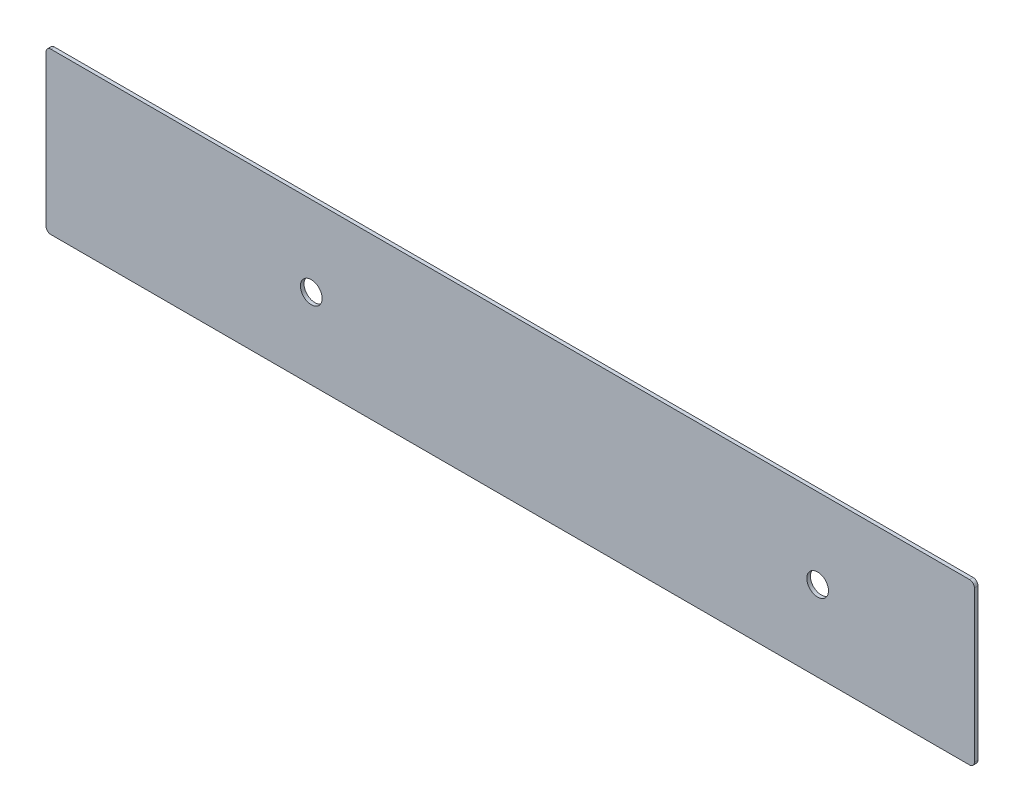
ISO-10303-21;
HEADER;
FILE_DESCRIPTION(('STEP AP214'),'2;1');
FILE_NAME('part.step','',(''),(''),'','','');
FILE_SCHEMA(('AUTOMOTIVE_DESIGN { 1 0 10303 214 1 1 1 1 }'));
ENDSEC;
DATA;
#1=APPLICATION_CONTEXT('core data for automotive mechanical design processes');
#2=APPLICATION_PROTOCOL_DEFINITION('international standard','automotive_design',2000,#1);
#3=PRODUCT_CONTEXT('',#1,'mechanical');
#4=PRODUCT('Part','Part','',(#3));
#5=PRODUCT_RELATED_PRODUCT_CATEGORY('part','',(#4));
#6=PRODUCT_DEFINITION_FORMATION('','',#4);
#7=PRODUCT_DEFINITION_CONTEXT('part definition',#1,'design');
#8=PRODUCT_DEFINITION('design','',#6,#7);
#9=PRODUCT_DEFINITION_SHAPE('','',#8);
#10=(LENGTH_UNIT() NAMED_UNIT(*) SI_UNIT(.MILLI.,.METRE.));
#11=(NAMED_UNIT(*) PLANE_ANGLE_UNIT() SI_UNIT($,.RADIAN.));
#12=(NAMED_UNIT(*) SI_UNIT($,.STERADIAN.) SOLID_ANGLE_UNIT());
#13=UNCERTAINTY_MEASURE_WITH_UNIT(LENGTH_MEASURE(1.E-05),#10,'distance_accuracy_value','');
#14=(GEOMETRIC_REPRESENTATION_CONTEXT(3) GLOBAL_UNCERTAINTY_ASSIGNED_CONTEXT((#13)) GLOBAL_UNIT_ASSIGNED_CONTEXT((#10,
#11,#12)) REPRESENTATION_CONTEXT('',''));
#15=CARTESIAN_POINT('',(0.,0.,0.));
#16=DIRECTION('',(0.,0.,1.));
#17=DIRECTION('',(1.,0.,0.));
#18=AXIS2_PLACEMENT_3D('',#15,#16,#17);
#19=CARTESIAN_POINT('',(0.,0.,1.5));
#20=DIRECTION('',(0.,0.,-1.));
#21=DIRECTION('',(-1.,0.,0.));
#22=AXIS2_PLACEMENT_3D('',#19,#20,#21);
#23=PLANE('',#22);
#24=DIRECTION('',(0.,1.,0.));
#25=VECTOR('',#24,1.);
#26=CARTESIAN_POINT('',(385.,0.,1.5));
#27=LINE('',#26,#25);
#28=CARTESIAN_POINT('',(385.,2.,1.5));
#29=VERTEX_POINT('',#28);
#30=CARTESIAN_POINT('',(385.,64.6,1.5));
#31=VERTEX_POINT('',#30);
#32=EDGE_CURVE('E173',#29,#31,#27,.T.);
#33=ORIENTED_EDGE('',*,*,#32,.T.);
#34=CARTESIAN_POINT('',(383.,64.6,1.5));
#35=DIRECTION('',(0.,0.,-1.));
#36=DIRECTION('',(-1.,0.,0.));
#37=AXIS2_PLACEMENT_3D('',#34,#35,#36);
#38=CIRCLE('',#37,2.);
#39=CARTESIAN_POINT('',(383.,66.6,1.5));
#40=VERTEX_POINT('',#39);
#41=EDGE_CURVE('E150',#31,#40,#38,.F.);
#42=ORIENTED_EDGE('',*,*,#41,.T.);
#43=DIRECTION('',(-1.,0.,0.));
#44=VECTOR('',#43,1.);
#45=CARTESIAN_POINT('',(0.,66.6,1.5));
#46=LINE('',#45,#44);
#47=CARTESIAN_POINT('',(2.,66.6,1.5));
#48=VERTEX_POINT('',#47);
#49=EDGE_CURVE('E121',#40,#48,#46,.T.);
#50=ORIENTED_EDGE('',*,*,#49,.T.);
#51=CARTESIAN_POINT('',(2.,64.6,1.5));
#52=DIRECTION('',(0.,0.,-1.));
#53=DIRECTION('',(-1.,0.,0.));
#54=AXIS2_PLACEMENT_3D('',#51,#52,#53);
#55=CIRCLE('',#54,2.);
#56=CARTESIAN_POINT('',(0.,64.6,1.5));
#57=VERTEX_POINT('',#56);
#58=EDGE_CURVE('E145',#48,#57,#55,.F.);
#59=ORIENTED_EDGE('',*,*,#58,.T.);
#60=DIRECTION('',(0.,-1.,0.));
#61=VECTOR('',#60,1.);
#62=CARTESIAN_POINT('',(0.,0.,1.5));
#63=LINE('',#62,#61);
#64=CARTESIAN_POINT('',(0.,2.,1.5));
#65=VERTEX_POINT('',#64);
#66=EDGE_CURVE('E128',#57,#65,#63,.T.);
#67=ORIENTED_EDGE('',*,*,#66,.T.);
#68=CARTESIAN_POINT('',(2.,2.,1.5));
#69=DIRECTION('',(0.,0.,-1.));
#70=DIRECTION('',(-1.,0.,0.));
#71=AXIS2_PLACEMENT_3D('',#68,#69,#70);
#72=CIRCLE('',#71,2.);
#73=CARTESIAN_POINT('',(2.,0.,1.5));
#74=VERTEX_POINT('',#73);
#75=EDGE_CURVE('E57',#65,#74,#72,.F.);
#76=ORIENTED_EDGE('',*,*,#75,.T.);
#77=DIRECTION('',(1.,0.,0.));
#78=VECTOR('',#77,1.);
#79=CARTESIAN_POINT('',(0.,0.,1.5));
#80=LINE('',#79,#78);
#81=CARTESIAN_POINT('',(383.,0.,1.5));
#82=VERTEX_POINT('',#81);
#83=EDGE_CURVE('E131',#74,#82,#80,.T.);
#84=ORIENTED_EDGE('',*,*,#83,.T.);
#85=CARTESIAN_POINT('',(383.,2.,1.5));
#86=DIRECTION('',(0.,0.,-1.));
#87=DIRECTION('',(-1.,0.,0.));
#88=AXIS2_PLACEMENT_3D('',#85,#86,#87);
#89=CIRCLE('',#88,2.);
#90=EDGE_CURVE('E148',#82,#29,#89,.F.);
#91=ORIENTED_EDGE('',*,*,#90,.T.);
#92=EDGE_LOOP('',(#33,#42,#50,#59,#67,#76,#84,#91));
#93=FACE_BOUND('',#92,.T.);
#94=CARTESIAN_POINT('',(110.,33.3,1.5));
#95=DIRECTION('',(0.,0.,1.));
#96=DIRECTION('',(1.,0.,0.));
#97=AXIS2_PLACEMENT_3D('',#94,#95,#96);
#98=CIRCLE('',#97,4.50000000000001);
#99=CARTESIAN_POINT('',(114.5,33.3,1.5));
#100=VERTEX_POINT('',#99);
#101=EDGE_CURVE('E166',#100,#100,#98,.T.);
#102=ORIENTED_EDGE('',*,*,#101,.F.);
#103=EDGE_LOOP('',(#102));
#104=FACE_BOUND('',#103,.T.);
#105=CARTESIAN_POINT('',(320.,33.3,1.5));
#106=DIRECTION('',(0.,0.,1.));
#107=DIRECTION('',(1.,0.,0.));
#108=AXIS2_PLACEMENT_3D('',#105,#106,#107);
#109=CIRCLE('',#108,4.50000000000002);
#110=CARTESIAN_POINT('',(324.5,33.3,1.5));
#111=VERTEX_POINT('',#110);
#112=EDGE_CURVE('E178',#111,#111,#109,.T.);
#113=ORIENTED_EDGE('',*,*,#112,.F.);
#114=EDGE_LOOP('',(#113));
#115=FACE_BOUND('',#114,.T.);
#116=ADVANCED_FACE('F35',(#93,#104,#115),#23,.F.);
#117=CARTESIAN_POINT('',(0.,0.,0.));
#118=DIRECTION('',(0.,0.,-1.));
#119=DIRECTION('',(-1.,0.,0.));
#120=AXIS2_PLACEMENT_3D('',#117,#118,#119);
#121=PLANE('',#120);
#122=CARTESIAN_POINT('',(110.,33.3,0.));
#123=DIRECTION('',(0.,0.,1.));
#124=DIRECTION('',(1.,0.,0.));
#125=AXIS2_PLACEMENT_3D('',#122,#123,#124);
#126=CIRCLE('',#125,4.50000000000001);
#127=CARTESIAN_POINT('',(114.5,33.3,0.));
#128=VERTEX_POINT('',#127);
#129=EDGE_CURVE('E169',#128,#128,#126,.T.);
#130=ORIENTED_EDGE('',*,*,#129,.T.);
#131=EDGE_LOOP('',(#130));
#132=FACE_BOUND('',#131,.T.);
#133=DIRECTION('',(-1.,0.,0.));
#134=VECTOR('',#133,1.);
#135=CARTESIAN_POINT('',(0.,66.6,0.));
#136=LINE('',#135,#134);
#137=CARTESIAN_POINT('',(383.,66.6,0.));
#138=VERTEX_POINT('',#137);
#139=CARTESIAN_POINT('',(2.,66.6,0.));
#140=VERTEX_POINT('',#139);
#141=EDGE_CURVE('E118',#138,#140,#136,.T.);
#142=ORIENTED_EDGE('',*,*,#141,.F.);
#143=CARTESIAN_POINT('',(383.,64.6,0.));
#144=DIRECTION('',(0.,0.,-1.));
#145=DIRECTION('',(-1.,0.,0.));
#146=AXIS2_PLACEMENT_3D('',#143,#144,#145);
#147=CIRCLE('',#146,2.);
#148=CARTESIAN_POINT('',(385.,64.6,0.));
#149=VERTEX_POINT('',#148);
#150=EDGE_CURVE('E101',#138,#149,#147,.T.);
#151=ORIENTED_EDGE('',*,*,#150,.T.);
#152=DIRECTION('',(0.,1.,0.));
#153=VECTOR('',#152,1.);
#154=CARTESIAN_POINT('',(385.,0.,0.));
#155=LINE('',#154,#153);
#156=CARTESIAN_POINT('',(385.,2.,0.));
#157=VERTEX_POINT('',#156);
#158=EDGE_CURVE('E129',#157,#149,#155,.T.);
#159=ORIENTED_EDGE('',*,*,#158,.F.);
#160=CARTESIAN_POINT('',(383.,2.,0.));
#161=DIRECTION('',(0.,0.,-1.));
#162=DIRECTION('',(-1.,0.,0.));
#163=AXIS2_PLACEMENT_3D('',#160,#161,#162);
#164=CIRCLE('',#163,2.);
#165=CARTESIAN_POINT('',(383.,0.,0.));
#166=VERTEX_POINT('',#165);
#167=EDGE_CURVE('E112',#157,#166,#164,.T.);
#168=ORIENTED_EDGE('',*,*,#167,.T.);
#169=DIRECTION('',(1.,0.,0.));
#170=VECTOR('',#169,1.);
#171=CARTESIAN_POINT('',(0.,0.,0.));
#172=LINE('',#171,#170);
#173=CARTESIAN_POINT('',(2.,0.,0.));
#174=VERTEX_POINT('',#173);
#175=EDGE_CURVE('E133',#174,#166,#172,.T.);
#176=ORIENTED_EDGE('',*,*,#175,.F.);
#177=CARTESIAN_POINT('',(2.,2.,0.));
#178=DIRECTION('',(0.,0.,-1.));
#179=DIRECTION('',(-1.,0.,0.));
#180=AXIS2_PLACEMENT_3D('',#177,#178,#179);
#181=CIRCLE('',#180,2.);
#182=CARTESIAN_POINT('',(0.,2.,0.));
#183=VERTEX_POINT('',#182);
#184=EDGE_CURVE('E139',#174,#183,#181,.T.);
#185=ORIENTED_EDGE('',*,*,#184,.T.);
#186=DIRECTION('',(0.,-1.,0.));
#187=VECTOR('',#186,1.);
#188=CARTESIAN_POINT('',(0.,0.,0.));
#189=LINE('',#188,#187);
#190=CARTESIAN_POINT('',(0.,64.6,0.));
#191=VERTEX_POINT('',#190);
#192=EDGE_CURVE('E161',#191,#183,#189,.T.);
#193=ORIENTED_EDGE('',*,*,#192,.F.);
#194=CARTESIAN_POINT('',(2.,64.6,0.));
#195=DIRECTION('',(0.,0.,-1.));
#196=DIRECTION('',(-1.,0.,0.));
#197=AXIS2_PLACEMENT_3D('',#194,#195,#196);
#198=CIRCLE('',#197,2.);
#199=EDGE_CURVE('E122',#191,#140,#198,.T.);
#200=ORIENTED_EDGE('',*,*,#199,.T.);
#201=EDGE_LOOP('',(#142,#151,#159,#168,#176,#185,#193,#200));
#202=FACE_BOUND('',#201,.T.);
#203=CARTESIAN_POINT('',(320.,33.3,0.));
#204=DIRECTION('',(0.,0.,1.));
#205=DIRECTION('',(1.,0.,0.));
#206=AXIS2_PLACEMENT_3D('',#203,#204,#205);
#207=CIRCLE('',#206,4.50000000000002);
#208=CARTESIAN_POINT('',(324.5,33.3,0.));
#209=VERTEX_POINT('',#208);
#210=EDGE_CURVE('E180',#209,#209,#207,.T.);
#211=ORIENTED_EDGE('',*,*,#210,.T.);
#212=EDGE_LOOP('',(#211));
#213=FACE_BOUND('',#212,.T.);
#214=ADVANCED_FACE('F125',(#132,#202,#213),#121,.T.);
#215=CARTESIAN_POINT('',(0.,0.,1.5));
#216=DIRECTION('',(1.,0.,0.));
#217=DIRECTION('',(0.,0.,-1.));
#218=AXIS2_PLACEMENT_3D('',#215,#216,#217);
#219=PLANE('',#218);
#220=ORIENTED_EDGE('',*,*,#192,.T.);
#221=DIRECTION('',(0.,0.,-1.));
#222=VECTOR('',#221,1.);
#223=CARTESIAN_POINT('',(0.,2.,1.5));
#224=LINE('',#223,#222);
#225=EDGE_CURVE('E11',#183,#65,#224,.F.);
#226=ORIENTED_EDGE('',*,*,#225,.T.);
#227=ORIENTED_EDGE('',*,*,#66,.F.);
#228=DIRECTION('',(0.,0.,-1.));
#229=VECTOR('',#228,1.);
#230=CARTESIAN_POINT('',(0.,64.6,1.5));
#231=LINE('',#230,#229);
#232=EDGE_CURVE('E43',#57,#191,#231,.T.);
#233=ORIENTED_EDGE('',*,*,#232,.T.);
#234=EDGE_LOOP('',(#220,#226,#227,#233));
#235=FACE_BOUND('',#234,.T.);
#236=ADVANCED_FACE('F160',(#235),#219,.F.);
#237=CARTESIAN_POINT('',(0.,0.,1.5));
#238=DIRECTION('',(0.,1.,0.));
#239=DIRECTION('',(0.,0.,1.));
#240=AXIS2_PLACEMENT_3D('',#237,#238,#239);
#241=PLANE('',#240);
#242=ORIENTED_EDGE('',*,*,#175,.T.);
#243=DIRECTION('',(0.,0.,-1.));
#244=VECTOR('',#243,1.);
#245=CARTESIAN_POINT('',(383.,0.,1.5));
#246=LINE('',#245,#244);
#247=EDGE_CURVE('E50',#166,#82,#246,.F.);
#248=ORIENTED_EDGE('',*,*,#247,.T.);
#249=ORIENTED_EDGE('',*,*,#83,.F.);
#250=DIRECTION('',(0.,0.,-1.));
#251=VECTOR('',#250,1.);
#252=CARTESIAN_POINT('',(2.,0.,1.5));
#253=LINE('',#252,#251);
#254=EDGE_CURVE('E152',#74,#174,#253,.T.);
#255=ORIENTED_EDGE('',*,*,#254,.T.);
#256=EDGE_LOOP('',(#242,#248,#249,#255));
#257=FACE_BOUND('',#256,.T.);
#258=ADVANCED_FACE('F206',(#257),#241,.F.);
#259=CARTESIAN_POINT('',(385.,0.,1.5));
#260=DIRECTION('',(-1.,0.,0.));
#261=DIRECTION('',(0.,0.,1.));
#262=AXIS2_PLACEMENT_3D('',#259,#260,#261);
#263=PLANE('',#262);
#264=ORIENTED_EDGE('',*,*,#158,.T.);
#265=DIRECTION('',(0.,0.,-1.));
#266=VECTOR('',#265,1.);
#267=CARTESIAN_POINT('',(385.,64.6,1.5));
#268=LINE('',#267,#266);
#269=EDGE_CURVE('E106',#149,#31,#268,.F.);
#270=ORIENTED_EDGE('',*,*,#269,.T.);
#271=ORIENTED_EDGE('',*,*,#32,.F.);
#272=DIRECTION('',(0.,0.,-1.));
#273=VECTOR('',#272,1.);
#274=CARTESIAN_POINT('',(385.,2.,1.5));
#275=LINE('',#274,#273);
#276=EDGE_CURVE('E111',#29,#157,#275,.T.);
#277=ORIENTED_EDGE('',*,*,#276,.T.);
#278=EDGE_LOOP('',(#264,#270,#271,#277));
#279=FACE_BOUND('',#278,.T.);
#280=ADVANCED_FACE('F203',(#279),#263,.F.);
#281=CARTESIAN_POINT('',(0.,66.6,1.5));
#282=DIRECTION('',(0.,-1.,0.));
#283=DIRECTION('',(0.,0.,-1.));
#284=AXIS2_PLACEMENT_3D('',#281,#282,#283);
#285=PLANE('',#284);
#286=ORIENTED_EDGE('',*,*,#49,.F.);
#287=DIRECTION('',(0.,0.,-1.));
#288=VECTOR('',#287,1.);
#289=CARTESIAN_POINT('',(383.,66.6,1.5));
#290=LINE('',#289,#288);
#291=EDGE_CURVE('E105',#40,#138,#290,.T.);
#292=ORIENTED_EDGE('',*,*,#291,.T.);
#293=ORIENTED_EDGE('',*,*,#141,.T.);
#294=DIRECTION('',(0.,0.,-1.));
#295=VECTOR('',#294,1.);
#296=CARTESIAN_POINT('',(2.,66.6,1.5));
#297=LINE('',#296,#295);
#298=EDGE_CURVE('E123',#140,#48,#297,.F.);
#299=ORIENTED_EDGE('',*,*,#298,.T.);
#300=EDGE_LOOP('',(#286,#292,#293,#299));
#301=FACE_BOUND('',#300,.T.);
#302=ADVANCED_FACE('F117',(#301),#285,.F.);
#303=CARTESIAN_POINT('',(110.,33.3,1.5));
#304=DIRECTION('',(0.,0.,-1.));
#305=DIRECTION('',(-1.,0.,0.));
#306=AXIS2_PLACEMENT_3D('',#303,#304,#305);
#307=CYLINDRICAL_SURFACE('',#306,4.50000000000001);
#308=ORIENTED_EDGE('',*,*,#101,.T.);
#309=EDGE_LOOP('',(#308));
#310=FACE_BOUND('',#309,.T.);
#311=ORIENTED_EDGE('',*,*,#129,.F.);
#312=EDGE_LOOP('',(#311));
#313=FACE_BOUND('',#312,.T.);
#314=ADVANCED_FACE('F198',(#310,#313),#307,.F.);
#315=CARTESIAN_POINT('',(320.,33.3,1.5));
#316=DIRECTION('',(0.,0.,-1.));
#317=DIRECTION('',(-1.,0.,0.));
#318=AXIS2_PLACEMENT_3D('',#315,#316,#317);
#319=CYLINDRICAL_SURFACE('',#318,4.50000000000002);
#320=ORIENTED_EDGE('',*,*,#112,.T.);
#321=EDGE_LOOP('',(#320));
#322=FACE_BOUND('',#321,.T.);
#323=ORIENTED_EDGE('',*,*,#210,.F.);
#324=EDGE_LOOP('',(#323));
#325=FACE_BOUND('',#324,.T.);
#326=ADVANCED_FACE('F186',(#322,#325),#319,.F.);
#327=CARTESIAN_POINT('',(383.,64.6,1.5));
#328=DIRECTION('',(0.,0.,-1.));
#329=DIRECTION('',(-1.,0.,0.));
#330=AXIS2_PLACEMENT_3D('',#327,#328,#329);
#331=CYLINDRICAL_SURFACE('',#330,2.);
#332=ORIENTED_EDGE('',*,*,#41,.F.);
#333=ORIENTED_EDGE('',*,*,#269,.F.);
#334=ORIENTED_EDGE('',*,*,#150,.F.);
#335=ORIENTED_EDGE('',*,*,#291,.F.);
#336=EDGE_LOOP('',(#332,#333,#334,#335));
#337=FACE_BOUND('',#336,.T.);
#338=ADVANCED_FACE('F104',(#337),#331,.T.);
#339=CARTESIAN_POINT('',(383.,2.,1.5));
#340=DIRECTION('',(0.,0.,-1.));
#341=DIRECTION('',(-1.,0.,0.));
#342=AXIS2_PLACEMENT_3D('',#339,#340,#341);
#343=CYLINDRICAL_SURFACE('',#342,2.);
#344=ORIENTED_EDGE('',*,*,#90,.F.);
#345=ORIENTED_EDGE('',*,*,#247,.F.);
#346=ORIENTED_EDGE('',*,*,#167,.F.);
#347=ORIENTED_EDGE('',*,*,#276,.F.);
#348=EDGE_LOOP('',(#344,#345,#346,#347));
#349=FACE_BOUND('',#348,.T.);
#350=ADVANCED_FACE('F214',(#349),#343,.T.);
#351=CARTESIAN_POINT('',(2.,2.,1.5));
#352=DIRECTION('',(0.,0.,-1.));
#353=DIRECTION('',(-1.,0.,0.));
#354=AXIS2_PLACEMENT_3D('',#351,#352,#353);
#355=CYLINDRICAL_SURFACE('',#354,2.);
#356=ORIENTED_EDGE('',*,*,#75,.F.);
#357=ORIENTED_EDGE('',*,*,#225,.F.);
#358=ORIENTED_EDGE('',*,*,#184,.F.);
#359=ORIENTED_EDGE('',*,*,#254,.F.);
#360=EDGE_LOOP('',(#356,#357,#358,#359));
#361=FACE_BOUND('',#360,.T.);
#362=ADVANCED_FACE('F216',(#361),#355,.T.);
#363=CARTESIAN_POINT('',(2.,64.6,1.5));
#364=DIRECTION('',(0.,0.,-1.));
#365=DIRECTION('',(-1.,0.,0.));
#366=AXIS2_PLACEMENT_3D('',#363,#364,#365);
#367=CYLINDRICAL_SURFACE('',#366,2.);
#368=ORIENTED_EDGE('',*,*,#58,.F.);
#369=ORIENTED_EDGE('',*,*,#298,.F.);
#370=ORIENTED_EDGE('',*,*,#199,.F.);
#371=ORIENTED_EDGE('',*,*,#232,.F.);
#372=EDGE_LOOP('',(#368,#369,#370,#371));
#373=FACE_BOUND('',#372,.T.);
#374=ADVANCED_FACE('F37',(#373),#367,.T.);
#375=CLOSED_SHELL('',(#116,#214,#236,#258,#280,#302,#314,#326,#338,#350,#362,#374));
#376=MANIFOLD_SOLID_BREP('B2',#375);
#377=ADVANCED_BREP_SHAPE_REPRESENTATION('',(#18,#376),#14);
#378=SHAPE_DEFINITION_REPRESENTATION(#9,#377);
ENDSEC;
END-ISO-10303-21;
